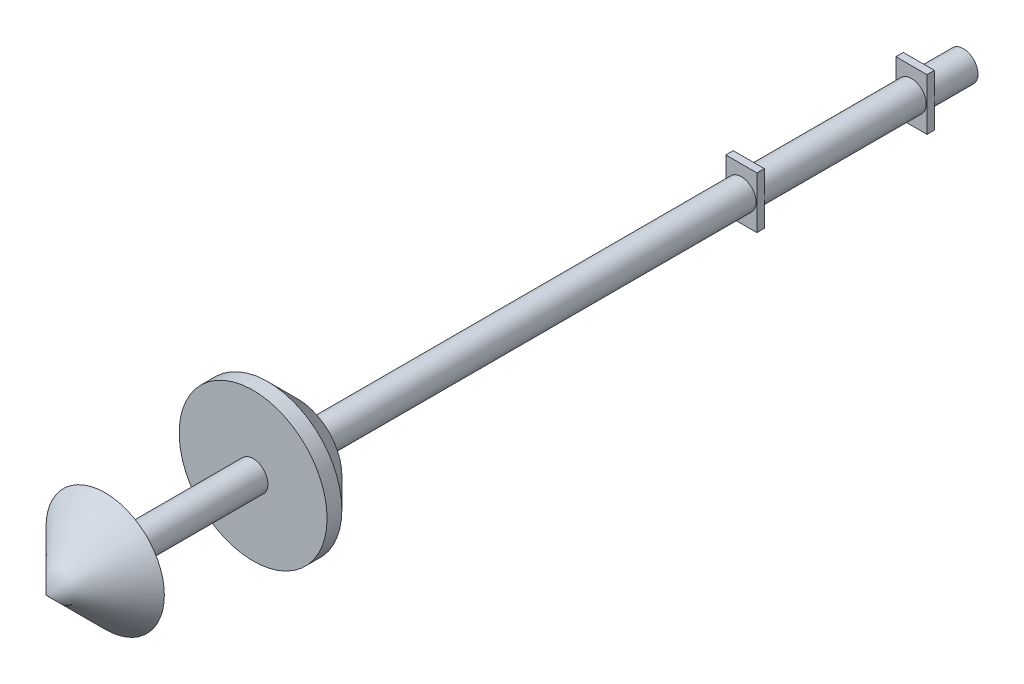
from build123d import *

# Parameters (mm, degrees)
ESQUISSE1_R      = 10
EXTRUSION1_DEPTH = 300
ESQUISSE2_W      = 21
ESQUISSE2_H      = 35
EXTRUSION2_DEPTH = 5
EXTRUSION3_START = 110
ESQUISSE3_R      = 10
EXTRUSION3_DEPTH = 110
ESQUISSE4_W      = 21
ESQUISSE4_H      = 35
EXTRUSION4_DEPTH = 5
EXTRUSION5_START = 30
ESQUISSE5_R      = 10
EXTRUSION5_DEPTH = 30
ESQUISSE7_R      = 50
EXTRUSION7_DEPTH = 30
CHANFREIN1_SIZE  = 20
ESQUISSE9_R      = 10
EXTRUSION8_DEPTH = 100


with BuildPart() as part:
    # Esquisse1 → Extrusion1 (new body)
    with BuildSketch(Plane.XY):
        Circle(ESQUISSE1_R)
    extrude(amount=EXTRUSION1_DEPTH)

    # Esquisse2 → Extrusion2 (add)
    with BuildSketch(Plane(origin=(0, 0, 0), x_dir=(-1, 0, 0), z_dir=(0, 0, -1))):
        Rectangle(ESQUISSE2_W, ESQUISSE2_H)
    extrude(amount=EXTRUSION2_DEPTH)

    # Esquisse3 → Extrusion3 (add)
    with BuildSketch(Plane(origin=(0, 0, -5), x_dir=(-1, 0, 0), z_dir=(0, 0, -1)).offset(EXTRUSION3_START)):
        Circle(ESQUISSE3_R)
    extrude(amount=-EXTRUSION3_DEPTH)

    # Esquisse4 → Extrusion4 (add)
    with BuildSketch(Plane(origin=(0, 0, -115), x_dir=(-1, 0, 0), z_dir=(0, 0, -1))):
        Rectangle(ESQUISSE4_W, ESQUISSE4_H)
    extrude(amount=EXTRUSION4_DEPTH)

    # Esquisse5 → Extrusion5 (add)
    with BuildSketch(Plane(origin=(0, 0, -120), x_dir=(-1, 0, 0), z_dir=(0, 0, -1)).offset(EXTRUSION5_START)):
        Circle(ESQUISSE5_R)
    extrude(amount=-EXTRUSION5_DEPTH)

    # Esquisse7 → Extrusion7 (add)
    with BuildSketch(Plane.XY.offset(300)):
        Circle(ESQUISSE7_R)
    extrude(amount=EXTRUSION7_DEPTH)

    # Chanfrein1
    chanfrein1_edges = [part.edges().sort_by_distance(p)[0] for p in [
        (-50, 0, 300),
    ]]
    chamfer(chanfrein1_edges, length=CHANFREIN1_SIZE)

    # Esquisse9 → Extrusion8 (add)
    with BuildSketch(Plane.XY.offset(330)):
        with Locations(Location((0, 0, 0), (0, 0, 180))):
            Circle(ESQUISSE9_R)
    extrude(amount=EXTRUSION8_DEPTH)

    # Esquisse10 → R_volution1 (revolve)
    with BuildSketch(Plane(origin=(0, 0, 0), x_dir=(0, 0, -1), z_dir=(1, 0, 0)), mode=Mode.PRIVATE) as r_volution1_sk:
        Polygon((-430, 0), (-430, 40), (-470, 0), align=None)
    revolve(r_volution1_sk.sketch.rotate(Axis((0, 0, 470), (0, 0, -1)), 270), axis=Axis((0, 0, 470), (0, 0, -1)))


solid = part.part
